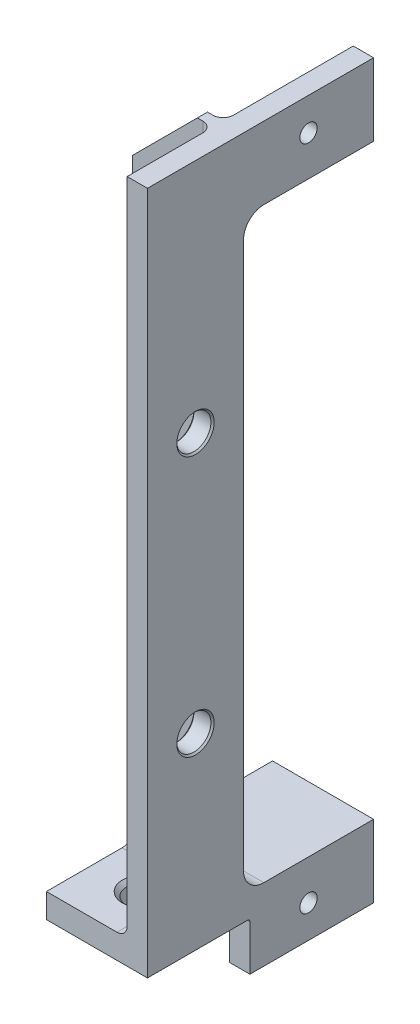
from build123d import *

# Parameters (mm, degrees)
BOSS_EXTRUDE1_DEPTH   = 3.175
BOSS_EXTRUDE2_DEPTH   = 12.607319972
FILLET1_R             = 1.5875
FILLET2_R             = 3.175
CUT_EXTRUDE1_DEPTH    = 62.949051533
F_6_32_TAPPED_HOLE1_D = 2.7051
SKETCH10_R            = 2.667
CUT_EXTRUDE2_DEPTH    = 65.796836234
CHAMFER1_SIZE         = 0.254
FILLET3_R             = 1.5875
FILLET4_R             = 0.39624


with BuildPart() as part:
    # Sketch1 → Boss-Extrude1 (new body)
    with BuildSketch(Plane(origin=(0, 0, 0), x_dir=(0, 0, -1), z_dir=(1, 0, 0))):
        Polygon((27.813, 57.15), (27.813, 45.847999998), (7.5, 45.847999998), (7.5, -45.847999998), (27.813, -45.847999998), (27.813, -57.15), (8.5, -57.15), (8.5, -49.657999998), (-7.5, -49.657999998), (-7.5, 57.15), align=None)
    extrude(amount=BOSS_EXTRUDE1_DEPTH)

    # Sketch2 → Boss-Extrude2 (add)
    with BuildSketch(Plane.ZY):
        Polygon((7.5, -49.657999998), (7.5, -45.847999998), (-5.9125, -45.847999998), (-5.9125, 57.15), (-7.5, 57.15), (-7.5, -45.847999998), (-27.813, -45.847999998), (-27.813, -49.657999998), align=None)
    extrude(amount=BOSS_EXTRUDE2_DEPTH)

    # Sketch4 → 10 Clearance Hole1 (revolve, cut)
    with BuildSketch(Plane(origin=(-5.10794, -49.657999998, 0), x_dir=(0, 0, -1), z_dir=(1, 0, 0))):
        Polygon((0, 0), (0, 3.81), (3.1242, 3.81), (2.4892, 3.175), (2.4892, 0.635), (3.1242, 0), align=None)
    revolve(axis=Axis((-5.10794, -56.007999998, 0), (0, 1, 0)), mode=Mode.SUBTRACT)

    # Fillet1
    fillet1_edges = [part.edges().sort_by_distance(p)[0] for p in [
        (-6.303659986, -45.847999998, -5.9125),
    ]]
    fillet(fillet1_edges, radius=FILLET1_R)

    # Fillet2
    fillet2_edges = [part.edges().sort_by_distance(p)[0] for p in [
        (-4.716159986, -45.847999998, -7.5),
        (1.5875, 45.847999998, -7.5),
    ]]
    fillet(fillet2_edges, radius=FILLET2_R)

    # Sketch6 → Cut-Extrude1 (cut, through all)
    with BuildSketch(Plane(origin=(0, 0, -7.5), x_dir=(-1, 0, 0), z_dir=(0, 0, -1))):
        Polygon((2.447319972, 57.15), (12.607319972, 57.15), (12.607319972, 46.99), align=None)
    extrude(amount=-CUT_EXTRUDE1_DEPTH, mode=Mode.SUBTRACT)

    # 6-32 Tapped Hole1 (through all)
    with Locations(Plane(origin=(3.175, 0, 0), x_dir=(0, 0, -1), z_dir=(1, 0, 0))):
        with Locations((17.653, 52.07)):
            f_6_32_tapped_hole1 = Hole(F_6_32_TAPPED_HOLE1_D / 2)

    # Sketch10 → Cut-Extrude2 (cut, through all)
    with BuildSketch(Plane.ZY):
        with Locations((0, 20.32)):
            Circle(SKETCH10_R)
    cut_extrude2 = extrude(amount=-CUT_EXTRUDE2_DEPTH, mode=Mode.SUBTRACT)

    # Mirror2: Cut-Extrude2 across plane
    add(cut_extrude2.mirror(Plane.ZX), mode=Mode.SUBTRACT)

    # Chamfer1
    chamfer1_edges = [part.edges().sort_by_distance(p)[0] for p in [
        (3.175, 20.32, -2.667),
        (0, 20.32, -2.667),
        (3.175, -20.32, -2.667),
        (0, -20.32, -2.667),
    ]]
    chamfer(chamfer1_edges, length=CHAMFER1_SIZE)

    # Fillet3
    fillet3_edges = [part.edges().sort_by_distance(p)[0] for p in [
        (0, 6.444750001, -5.9125),
        (0, -45.383032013, -5.447532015),
        (0, -49.657999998, -18.1565),
        (0, 49.911499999, -7.5),
        (0, -45.847999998, 1.5875),
    ]]
    fillet(fillet3_edges, radius=FILLET3_R)

    # Mirror1: 6-32 Tapped Hole1 across plane
    add(f_6_32_tapped_hole1.mirror(Plane.ZX), mode=Mode.SUBTRACT)

    # Fillet4
    fillet4_edges = [part.edges().sort_by_distance(p)[0] for p in [
        (0.79375, -49.657999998, -8.5),
    ]]
    fillet(fillet4_edges, radius=FILLET4_R)


solid = part.part
